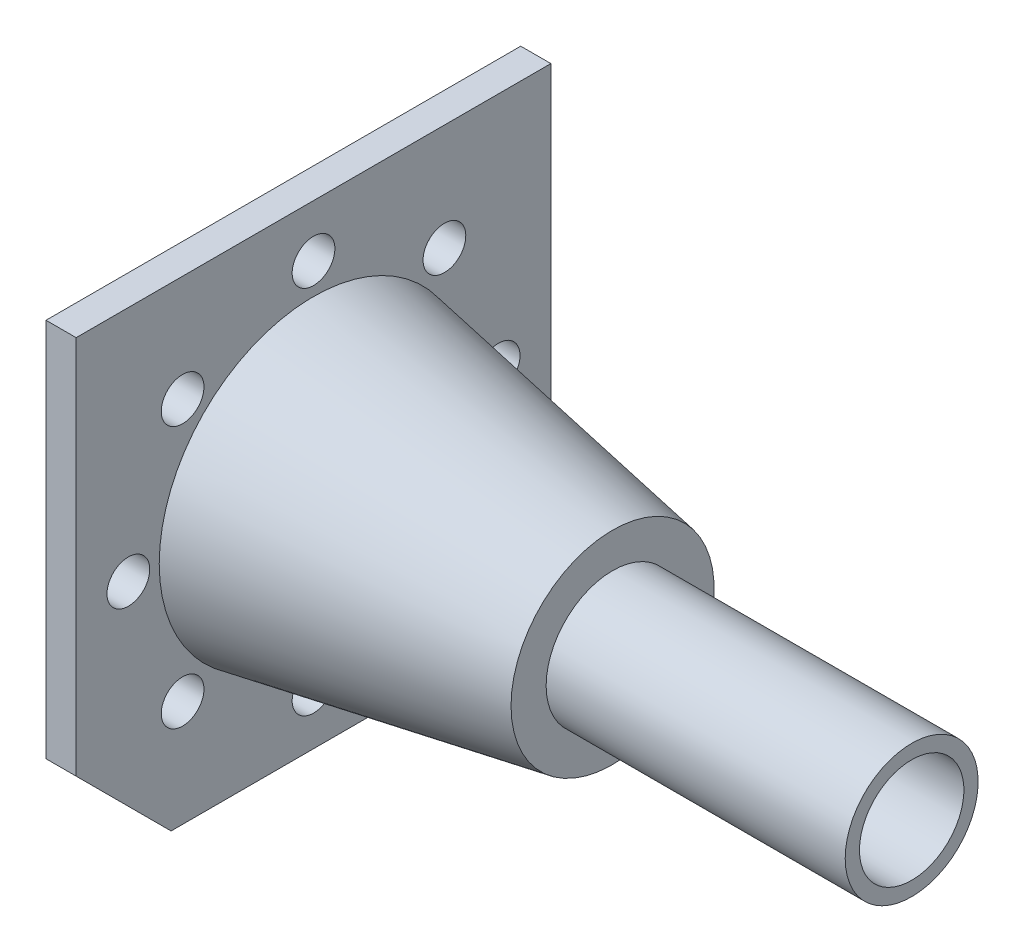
from build123d import *

# Parameters (mm, degrees)
SKETCH1_W           = 100
SKETCH1_H           = 100
BOSS_EXTRUDE1_DEPTH = 6.35
SKETCH2_R           = 4.5
CUT_EXTRUDE1_DEPTH  = 95.704804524
CIRPATTERN1_COUNT   = 8
SKETCH6_R           = 14
SKETCH6_R_2         = 11
BOSS_EXTRUDE2_DEPTH = 63
CHAMFER1_SIZE       = 20


with BuildPart() as part:
    # Sketch1 → Boss-Extrude1 (new body)
    with BuildSketch(Plane(origin=(0, 0, 0), x_dir=(0, -1, 0), z_dir=(1, 0, 0))):
        Rectangle(SKETCH1_W, SKETCH1_H)
    extrude(amount=BOSS_EXTRUDE1_DEPTH)

    # Sketch5 → Revolve1 (revolve)
    with BuildSketch(Plane.XY, mode=Mode.PRIVATE) as revolve1_sk:
        Polygon((6.35, 0), (69.35, 0), (69.35, -21.391400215), (6.35, -32.5), align=None)
    revolve(revolve1_sk.sketch.rotate(Axis((6.35, 0, 0), (1, 0, 0)), 270), axis=Axis((6.35, 0, 0), (1, 0, 0)))

    # Sketch2 → Cut-Extrude1 (cut, through all)
    with BuildSketch(Plane(origin=(6.35, 0, 0), x_dir=(0, -1, 0), z_dir=(1, 0, 0))):
        with Locations(Location((-39, 0, 0), (0, 0, 180))):
            Circle(SKETCH2_R)
    cut_extrude1 = extrude(amount=-CUT_EXTRUDE1_DEPTH, mode=Mode.SUBTRACT)

    # CirPattern1: Cut-Extrude1 ×8 about axis
    cirpattern1_axis = Axis((0, 0, 0), (1, 0, 0))
    for i in range(1, CIRPATTERN1_COUNT):
        add(cut_extrude1.rotate(cirpattern1_axis, i * 360 / CIRPATTERN1_COUNT), mode=Mode.SUBTRACT)

    # Sketch6 → Boss-Extrude2 (add)
    with BuildSketch(Plane(origin=(69.35, 0, 0), x_dir=(0, 1, 0), z_dir=(-1, 0, 0))):
        with Locations(Location((0, 0, 0), (0, 0, 270))):
            Circle(SKETCH6_R)
        with Locations(Location((0, 0, 0), (0, 0, 270))):
            Circle(SKETCH6_R_2, mode=Mode.SUBTRACT)
    extrude(amount=-BOSS_EXTRUDE2_DEPTH)

    # Chamfer1
    chamfer1_edges = [part.edges().sort_by_distance(p)[0] for p in [
        (3.175, -50, 50),
    ]]
    chamfer(chamfer1_edges, length=CHAMFER1_SIZE)


solid = part.part
